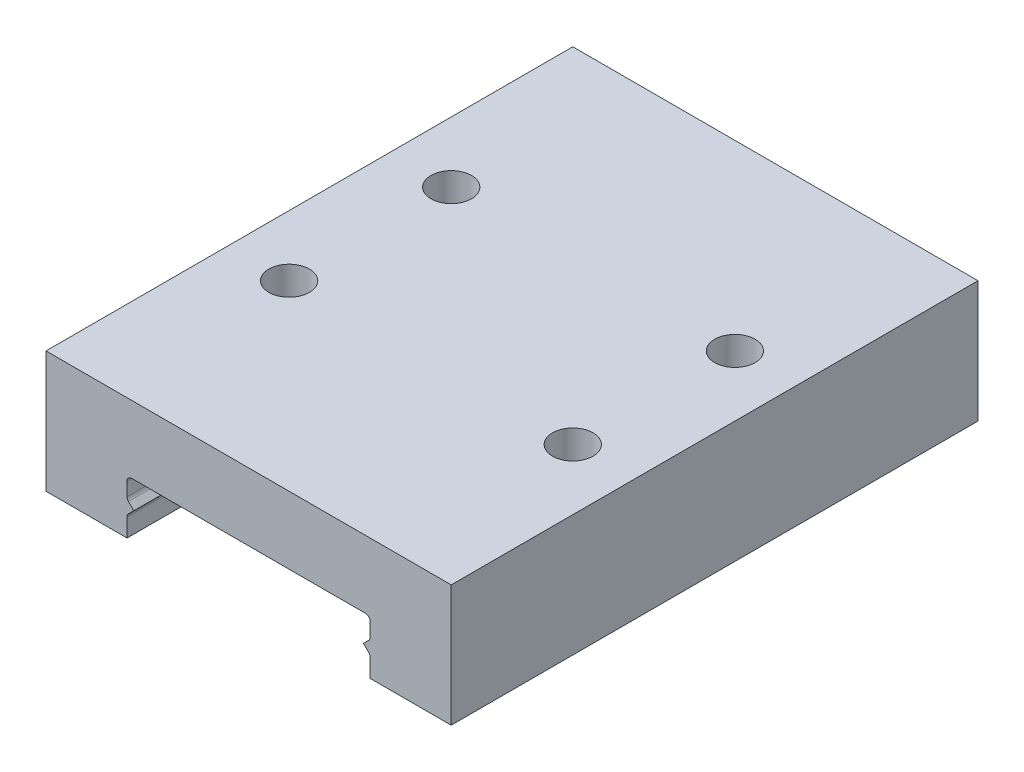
ISO-10303-21;
HEADER;
FILE_DESCRIPTION(('STEP AP214'),'2;1');
FILE_NAME('part.step','',(''),(''),'','','');
FILE_SCHEMA(('AUTOMOTIVE_DESIGN { 1 0 10303 214 1 1 1 1 }'));
ENDSEC;
DATA;
#1=APPLICATION_CONTEXT('core data for automotive mechanical design processes');
#2=APPLICATION_PROTOCOL_DEFINITION('international standard','automotive_design',2000,#1);
#3=PRODUCT_CONTEXT('',#1,'mechanical');
#4=PRODUCT('Part','Part','',(#3));
#5=PRODUCT_RELATED_PRODUCT_CATEGORY('part','',(#4));
#6=PRODUCT_DEFINITION_FORMATION('','',#4);
#7=PRODUCT_DEFINITION_CONTEXT('part definition',#1,'design');
#8=PRODUCT_DEFINITION('design','',#6,#7);
#9=PRODUCT_DEFINITION_SHAPE('','',#8);
#10=(LENGTH_UNIT() NAMED_UNIT(*) SI_UNIT(.MILLI.,.METRE.));
#11=(NAMED_UNIT(*) PLANE_ANGLE_UNIT() SI_UNIT($,.RADIAN.));
#12=(NAMED_UNIT(*) SI_UNIT($,.STERADIAN.) SOLID_ANGLE_UNIT());
#13=UNCERTAINTY_MEASURE_WITH_UNIT(LENGTH_MEASURE(1.E-05),#10,'distance_accuracy_value','');
#14=(GEOMETRIC_REPRESENTATION_CONTEXT(3) GLOBAL_UNCERTAINTY_ASSIGNED_CONTEXT((#13)) GLOBAL_UNIT_ASSIGNED_CONTEXT((#10,
#11,#12)) REPRESENTATION_CONTEXT('',''));
#15=CARTESIAN_POINT('',(0.,0.,0.));
#16=DIRECTION('',(0.,0.,1.));
#17=DIRECTION('',(1.,0.,0.));
#18=AXIS2_PLACEMENT_3D('',#15,#16,#17);
#19=CARTESIAN_POINT('',(-15.,3.,39.));
#20=DIRECTION('',(0.,1.,0.));
#21=DIRECTION('',(0.,0.,1.));
#22=AXIS2_PLACEMENT_3D('',#19,#20,#21);
#23=PLANE('',#22);
#24=DIRECTION('',(0.,0.,1.));
#25=VECTOR('',#24,1.);
#26=CARTESIAN_POINT('',(9.,3.,39.));
#27=LINE('',#26,#25);
#28=CARTESIAN_POINT('',(9.,3.,0.));
#29=VERTEX_POINT('',#28);
#30=CARTESIAN_POINT('',(9.,3.,39.));
#31=VERTEX_POINT('',#30);
#32=EDGE_CURVE('E257',#29,#31,#27,.T.);
#33=ORIENTED_EDGE('',*,*,#32,.F.);
#34=DIRECTION('',(1.,0.,0.));
#35=VECTOR('',#34,1.);
#36=CARTESIAN_POINT('',(-15.,3.,0.));
#37=LINE('',#36,#35);
#38=CARTESIAN_POINT('',(15.,3.,0.));
#39=VERTEX_POINT('',#38);
#40=EDGE_CURVE('E293',#29,#39,#37,.T.);
#41=ORIENTED_EDGE('',*,*,#40,.T.);
#42=DIRECTION('',(0.,0.,-1.));
#43=VECTOR('',#42,1.);
#44=CARTESIAN_POINT('',(15.,3.,39.));
#45=LINE('',#44,#43);
#46=CARTESIAN_POINT('',(15.,3.,39.));
#47=VERTEX_POINT('',#46);
#48=EDGE_CURVE('E318',#47,#39,#45,.T.);
#49=ORIENTED_EDGE('',*,*,#48,.F.);
#50=DIRECTION('',(1.,0.,0.));
#51=VECTOR('',#50,1.);
#52=CARTESIAN_POINT('',(-15.,3.,39.));
#53=LINE('',#52,#51);
#54=EDGE_CURVE('E304',#31,#47,#53,.T.);
#55=ORIENTED_EDGE('',*,*,#54,.F.);
#56=EDGE_LOOP('',(#33,#41,#49,#55));
#57=FACE_BOUND('',#56,.T.);
#58=ADVANCED_FACE('F30',(#57),#23,.F.);
#59=CARTESIAN_POINT('',(-15.,3.,39.));
#60=DIRECTION('',(0.,0.,1.));
#61=DIRECTION('',(1.,0.,0.));
#62=AXIS2_PLACEMENT_3D('',#59,#60,#61);
#63=PLANE('',#62);
#64=DIRECTION('',(-0.707106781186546,0.707106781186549,0.));
#65=VECTOR('',#64,1.);
#66=CARTESIAN_POINT('',(8.5,5.,39.));
#67=LINE('',#66,#65);
#68=CARTESIAN_POINT('',(8.89748737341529,4.60251262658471,39.));
#69=VERTEX_POINT('',#68);
#70=CARTESIAN_POINT('',(8.5,5.,39.));
#71=VERTEX_POINT('',#70);
#72=EDGE_CURVE('E249',#69,#71,#67,.T.);
#73=ORIENTED_EDGE('',*,*,#72,.F.);
#74=CARTESIAN_POINT('',(8.65,4.35502525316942,39.));
#75=DIRECTION('',(0.,0.,1.));
#76=DIRECTION('',(1.,0.,0.));
#77=AXIS2_PLACEMENT_3D('',#74,#75,#76);
#78=CIRCLE('',#77,0.35);
#79=CARTESIAN_POINT('',(9.,4.35502525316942,39.));
#80=VERTEX_POINT('',#79);
#81=EDGE_CURVE('E369',#69,#80,#78,.F.);
#82=ORIENTED_EDGE('',*,*,#81,.T.);
#83=DIRECTION('',(0.,1.,0.));
#84=VECTOR('',#83,1.);
#85=CARTESIAN_POINT('',(9.,0.830210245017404,39.));
#86=LINE('',#85,#84);
#87=EDGE_CURVE('E251',#31,#80,#86,.T.);
#88=ORIENTED_EDGE('',*,*,#87,.F.);
#89=ORIENTED_EDGE('',*,*,#54,.T.);
#90=DIRECTION('',(0.,1.,0.));
#91=VECTOR('',#90,1.);
#92=CARTESIAN_POINT('',(15.,12.,39.));
#93=LINE('',#92,#91);
#94=CARTESIAN_POINT('',(15.,12.,39.));
#95=VERTEX_POINT('',#94);
#96=EDGE_CURVE('E308',#47,#95,#93,.T.);
#97=ORIENTED_EDGE('',*,*,#96,.T.);
#98=DIRECTION('',(-1.,0.,0.));
#99=VECTOR('',#98,1.);
#100=CARTESIAN_POINT('',(-15.,12.,39.));
#101=LINE('',#100,#99);
#102=CARTESIAN_POINT('',(-15.,12.,39.));
#103=VERTEX_POINT('',#102);
#104=EDGE_CURVE('E310',#95,#103,#101,.T.);
#105=ORIENTED_EDGE('',*,*,#104,.T.);
#106=DIRECTION('',(0.,-1.,0.));
#107=VECTOR('',#106,1.);
#108=CARTESIAN_POINT('',(-15.,12.,39.));
#109=LINE('',#108,#107);
#110=CARTESIAN_POINT('',(-15.,3.,39.));
#111=VERTEX_POINT('',#110);
#112=EDGE_CURVE('E301',#103,#111,#109,.T.);
#113=ORIENTED_EDGE('',*,*,#112,.T.);
#114=CARTESIAN_POINT('',(-9.,3.,39.));
#115=VERTEX_POINT('',#114);
#116=EDGE_CURVE('E305',#111,#115,#53,.T.);
#117=ORIENTED_EDGE('',*,*,#116,.T.);
#118=DIRECTION('',(0.,1.,0.));
#119=VECTOR('',#118,1.);
#120=CARTESIAN_POINT('',(-9.,0.830210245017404,39.));
#121=LINE('',#120,#119);
#122=CARTESIAN_POINT('',(-9.,4.35502525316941,39.));
#123=VERTEX_POINT('',#122);
#124=EDGE_CURVE('E270',#115,#123,#121,.T.);
#125=ORIENTED_EDGE('',*,*,#124,.T.);
#126=CARTESIAN_POINT('',(-8.65,4.35502525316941,39.));
#127=DIRECTION('',(0.,0.,1.));
#128=DIRECTION('',(1.,0.,0.));
#129=AXIS2_PLACEMENT_3D('',#126,#127,#128);
#130=CIRCLE('',#129,0.35);
#131=CARTESIAN_POINT('',(-8.89748737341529,4.60251262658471,39.));
#132=VERTEX_POINT('',#131);
#133=EDGE_CURVE('E343',#123,#132,#130,.F.);
#134=ORIENTED_EDGE('',*,*,#133,.T.);
#135=DIRECTION('',(0.707106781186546,0.707106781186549,0.));
#136=VECTOR('',#135,1.);
#137=CARTESIAN_POINT('',(-8.5,5.,39.));
#138=LINE('',#137,#136);
#139=CARTESIAN_POINT('',(-8.5,5.,39.));
#140=VERTEX_POINT('',#139);
#141=EDGE_CURVE('E273',#132,#140,#138,.T.);
#142=ORIENTED_EDGE('',*,*,#141,.T.);
#143=DIRECTION('',(-0.707106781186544,0.707106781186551,0.));
#144=VECTOR('',#143,1.);
#145=CARTESIAN_POINT('',(-9.,5.5,39.));
#146=LINE('',#145,#144);
#147=CARTESIAN_POINT('',(-8.89748737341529,5.39748737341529,39.));
#148=VERTEX_POINT('',#147);
#149=EDGE_CURVE('E275',#140,#148,#146,.T.);
#150=ORIENTED_EDGE('',*,*,#149,.T.);
#151=CARTESIAN_POINT('',(-8.65,5.64497474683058,39.));
#152=DIRECTION('',(0.,0.,1.));
#153=DIRECTION('',(1.,0.,0.));
#154=AXIS2_PLACEMENT_3D('',#151,#152,#153);
#155=CIRCLE('',#154,0.35);
#156=CARTESIAN_POINT('',(-9.,5.64497474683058,39.));
#157=VERTEX_POINT('',#156);
#158=EDGE_CURVE('E351',#148,#157,#155,.F.);
#159=ORIENTED_EDGE('',*,*,#158,.T.);
#160=DIRECTION('',(0.,1.,0.));
#161=VECTOR('',#160,1.);
#162=CARTESIAN_POINT('',(-9.,7.,39.));
#163=LINE('',#162,#161);
#164=CARTESIAN_POINT('',(-9.,6.65,39.));
#165=VERTEX_POINT('',#164);
#166=EDGE_CURVE('E278',#157,#165,#163,.T.);
#167=ORIENTED_EDGE('',*,*,#166,.T.);
#168=CARTESIAN_POINT('',(-8.65,6.65,39.));
#169=DIRECTION('',(0.,0.,1.));
#170=DIRECTION('',(1.,0.,0.));
#171=AXIS2_PLACEMENT_3D('',#168,#169,#170);
#172=CIRCLE('',#171,0.35);
#173=CARTESIAN_POINT('',(-8.65,7.,39.));
#174=VERTEX_POINT('',#173);
#175=EDGE_CURVE('E347',#165,#174,#172,.F.);
#176=ORIENTED_EDGE('',*,*,#175,.T.);
#177=DIRECTION('',(1.,0.,0.));
#178=VECTOR('',#177,1.);
#179=CARTESIAN_POINT('',(0.,7.,39.));
#180=LINE('',#179,#178);
#181=CARTESIAN_POINT('',(8.65,7.,39.));
#182=VERTEX_POINT('',#181);
#183=EDGE_CURVE('E281',#174,#182,#180,.T.);
#184=ORIENTED_EDGE('',*,*,#183,.T.);
#185=CARTESIAN_POINT('',(8.65,6.65,39.));
#186=DIRECTION('',(0.,0.,1.));
#187=DIRECTION('',(1.,0.,0.));
#188=AXIS2_PLACEMENT_3D('',#185,#186,#187);
#189=CIRCLE('',#188,0.35);
#190=CARTESIAN_POINT('',(9.,6.65,39.));
#191=VERTEX_POINT('',#190);
#192=EDGE_CURVE('E373',#182,#191,#189,.F.);
#193=ORIENTED_EDGE('',*,*,#192,.T.);
#194=DIRECTION('',(0.,1.,0.));
#195=VECTOR('',#194,1.);
#196=CARTESIAN_POINT('',(9.,7.,39.));
#197=LINE('',#196,#195);
#198=CARTESIAN_POINT('',(9.,5.64497474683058,39.));
#199=VERTEX_POINT('',#198);
#200=EDGE_CURVE('E244',#199,#191,#197,.T.);
#201=ORIENTED_EDGE('',*,*,#200,.F.);
#202=CARTESIAN_POINT('',(8.65,5.64497474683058,39.));
#203=DIRECTION('',(0.,0.,1.));
#204=DIRECTION('',(1.,0.,0.));
#205=AXIS2_PLACEMENT_3D('',#202,#203,#204);
#206=CIRCLE('',#205,0.35);
#207=CARTESIAN_POINT('',(8.89748737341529,5.39748737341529,39.));
#208=VERTEX_POINT('',#207);
#209=EDGE_CURVE('E11',#199,#208,#206,.F.);
#210=ORIENTED_EDGE('',*,*,#209,.T.);
#211=DIRECTION('',(0.707106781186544,0.707106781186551,0.));
#212=VECTOR('',#211,1.);
#213=CARTESIAN_POINT('',(9.,5.5,39.));
#214=LINE('',#213,#212);
#215=EDGE_CURVE('E247',#71,#208,#214,.T.);
#216=ORIENTED_EDGE('',*,*,#215,.F.);
#217=EDGE_LOOP('',(#73,#82,#88,#89,#97,#105,#113,#117,#125,#134,#142,#150,#159,#167,#176,#184,
#193,#201,#210,#216));
#218=FACE_BOUND('',#217,.T.);
#219=ADVANCED_FACE('F386',(#218),#63,.T.);
#220=CARTESIAN_POINT('',(-15.,3.,0.));
#221=DIRECTION('',(0.,0.,1.));
#222=DIRECTION('',(1.,0.,0.));
#223=AXIS2_PLACEMENT_3D('',#220,#221,#222);
#224=PLANE('',#223);
#225=DIRECTION('',(0.,1.,0.));
#226=VECTOR('',#225,1.);
#227=CARTESIAN_POINT('',(9.,0.830210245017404,0.));
#228=LINE('',#227,#226);
#229=CARTESIAN_POINT('',(9.,4.35502525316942,0.));
#230=VERTEX_POINT('',#229);
#231=EDGE_CURVE('E241',#29,#230,#228,.T.);
#232=ORIENTED_EDGE('',*,*,#231,.T.);
#233=CARTESIAN_POINT('',(8.65,4.35502525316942,0.));
#234=DIRECTION('',(0.,0.,1.));
#235=DIRECTION('',(1.,0.,0.));
#236=AXIS2_PLACEMENT_3D('',#233,#234,#235);
#237=CIRCLE('',#236,0.35);
#238=CARTESIAN_POINT('',(8.89748737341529,4.60251262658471,0.));
#239=VERTEX_POINT('',#238);
#240=EDGE_CURVE('E367',#230,#239,#237,.T.);
#241=ORIENTED_EDGE('',*,*,#240,.T.);
#242=DIRECTION('',(-0.707106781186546,0.707106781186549,0.));
#243=VECTOR('',#242,1.);
#244=CARTESIAN_POINT('',(8.5,5.,0.));
#245=LINE('',#244,#243);
#246=CARTESIAN_POINT('',(8.5,5.,0.));
#247=VERTEX_POINT('',#246);
#248=EDGE_CURVE('E239',#239,#247,#245,.T.);
#249=ORIENTED_EDGE('',*,*,#248,.T.);
#250=DIRECTION('',(0.707106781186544,0.707106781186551,0.));
#251=VECTOR('',#250,1.);
#252=CARTESIAN_POINT('',(9.,5.5,0.));
#253=LINE('',#252,#251);
#254=CARTESIAN_POINT('',(8.89748737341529,5.39748737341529,0.));
#255=VERTEX_POINT('',#254);
#256=EDGE_CURVE('E236',#247,#255,#253,.T.);
#257=ORIENTED_EDGE('',*,*,#256,.T.);
#258=CARTESIAN_POINT('',(8.65,5.64497474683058,0.));
#259=DIRECTION('',(0.,0.,1.));
#260=DIRECTION('',(1.,0.,0.));
#261=AXIS2_PLACEMENT_3D('',#258,#259,#260);
#262=CIRCLE('',#261,0.35);
#263=CARTESIAN_POINT('',(9.,5.64497474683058,0.));
#264=VERTEX_POINT('',#263);
#265=EDGE_CURVE('E38',#255,#264,#262,.T.);
#266=ORIENTED_EDGE('',*,*,#265,.T.);
#267=DIRECTION('',(0.,1.,0.));
#268=VECTOR('',#267,1.);
#269=CARTESIAN_POINT('',(9.,7.,0.));
#270=LINE('',#269,#268);
#271=CARTESIAN_POINT('',(9.,6.65,0.));
#272=VERTEX_POINT('',#271);
#273=EDGE_CURVE('E233',#264,#272,#270,.T.);
#274=ORIENTED_EDGE('',*,*,#273,.T.);
#275=CARTESIAN_POINT('',(8.65,6.65,0.));
#276=DIRECTION('',(0.,0.,1.));
#277=DIRECTION('',(1.,0.,0.));
#278=AXIS2_PLACEMENT_3D('',#275,#276,#277);
#279=CIRCLE('',#278,0.35);
#280=CARTESIAN_POINT('',(8.65,7.,0.));
#281=VERTEX_POINT('',#280);
#282=EDGE_CURVE('E371',#272,#281,#279,.T.);
#283=ORIENTED_EDGE('',*,*,#282,.T.);
#284=DIRECTION('',(1.,0.,0.));
#285=VECTOR('',#284,1.);
#286=CARTESIAN_POINT('',(0.,7.,0.));
#287=LINE('',#286,#285);
#288=CARTESIAN_POINT('',(-8.65,7.,0.));
#289=VERTEX_POINT('',#288);
#290=EDGE_CURVE('E267',#289,#281,#287,.T.);
#291=ORIENTED_EDGE('',*,*,#290,.F.);
#292=CARTESIAN_POINT('',(-8.65,6.65,0.));
#293=DIRECTION('',(0.,0.,1.));
#294=DIRECTION('',(1.,0.,0.));
#295=AXIS2_PLACEMENT_3D('',#292,#293,#294);
#296=CIRCLE('',#295,0.35);
#297=CARTESIAN_POINT('',(-9.,6.65,0.));
#298=VERTEX_POINT('',#297);
#299=EDGE_CURVE('E345',#289,#298,#296,.T.);
#300=ORIENTED_EDGE('',*,*,#299,.T.);
#301=DIRECTION('',(0.,1.,0.));
#302=VECTOR('',#301,1.);
#303=CARTESIAN_POINT('',(-9.,7.,0.));
#304=LINE('',#303,#302);
#305=CARTESIAN_POINT('',(-9.,5.64497474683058,0.));
#306=VERTEX_POINT('',#305);
#307=EDGE_CURVE('E264',#306,#298,#304,.T.);
#308=ORIENTED_EDGE('',*,*,#307,.F.);
#309=CARTESIAN_POINT('',(-8.65,5.64497474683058,0.));
#310=DIRECTION('',(0.,0.,1.));
#311=DIRECTION('',(1.,0.,0.));
#312=AXIS2_PLACEMENT_3D('',#309,#310,#311);
#313=CIRCLE('',#312,0.35);
#314=CARTESIAN_POINT('',(-8.89748737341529,5.39748737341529,0.));
#315=VERTEX_POINT('',#314);
#316=EDGE_CURVE('E349',#306,#315,#313,.T.);
#317=ORIENTED_EDGE('',*,*,#316,.T.);
#318=DIRECTION('',(-0.707106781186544,0.707106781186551,0.));
#319=VECTOR('',#318,1.);
#320=CARTESIAN_POINT('',(-9.,5.5,0.));
#321=LINE('',#320,#319);
#322=CARTESIAN_POINT('',(-8.5,5.,0.));
#323=VERTEX_POINT('',#322);
#324=EDGE_CURVE('E261',#323,#315,#321,.T.);
#325=ORIENTED_EDGE('',*,*,#324,.F.);
#326=DIRECTION('',(0.707106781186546,0.707106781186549,0.));
#327=VECTOR('',#326,1.);
#328=CARTESIAN_POINT('',(-8.5,5.,0.));
#329=LINE('',#328,#327);
#330=CARTESIAN_POINT('',(-8.89748737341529,4.60251262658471,0.));
#331=VERTEX_POINT('',#330);
#332=EDGE_CURVE('E259',#331,#323,#329,.T.);
#333=ORIENTED_EDGE('',*,*,#332,.F.);
#334=CARTESIAN_POINT('',(-8.65,4.35502525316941,0.));
#335=DIRECTION('',(0.,0.,1.));
#336=DIRECTION('',(1.,0.,0.));
#337=AXIS2_PLACEMENT_3D('',#334,#335,#336);
#338=CIRCLE('',#337,0.35);
#339=CARTESIAN_POINT('',(-9.,4.35502525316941,0.));
#340=VERTEX_POINT('',#339);
#341=EDGE_CURVE('E341',#331,#340,#338,.T.);
#342=ORIENTED_EDGE('',*,*,#341,.T.);
#343=DIRECTION('',(0.,-1.,0.));
#344=VECTOR('',#343,1.);
#345=CARTESIAN_POINT('',(-9.,3.,0.));
#346=LINE('',#345,#344);
#347=CARTESIAN_POINT('',(-9.,3.,0.));
#348=VERTEX_POINT('',#347);
#349=EDGE_CURVE('E324',#340,#348,#346,.T.);
#350=ORIENTED_EDGE('',*,*,#349,.T.);
#351=CARTESIAN_POINT('',(-15.,3.,0.));
#352=VERTEX_POINT('',#351);
#353=EDGE_CURVE('E294',#352,#348,#37,.T.);
#354=ORIENTED_EDGE('',*,*,#353,.F.);
#355=DIRECTION('',(0.,-1.,0.));
#356=VECTOR('',#355,1.);
#357=CARTESIAN_POINT('',(-15.,12.,0.));
#358=LINE('',#357,#356);
#359=CARTESIAN_POINT('',(-15.,12.,0.));
#360=VERTEX_POINT('',#359);
#361=EDGE_CURVE('E290',#360,#352,#358,.T.);
#362=ORIENTED_EDGE('',*,*,#361,.F.);
#363=DIRECTION('',(-1.,0.,0.));
#364=VECTOR('',#363,1.);
#365=CARTESIAN_POINT('',(-15.,12.,0.));
#366=LINE('',#365,#364);
#367=CARTESIAN_POINT('',(15.,12.,0.));
#368=VERTEX_POINT('',#367);
#369=EDGE_CURVE('E299',#368,#360,#366,.T.);
#370=ORIENTED_EDGE('',*,*,#369,.F.);
#371=DIRECTION('',(0.,1.,0.));
#372=VECTOR('',#371,1.);
#373=CARTESIAN_POINT('',(15.,12.,0.));
#374=LINE('',#373,#372);
#375=EDGE_CURVE('E297',#39,#368,#374,.T.);
#376=ORIENTED_EDGE('',*,*,#375,.F.);
#377=ORIENTED_EDGE('',*,*,#40,.F.);
#378=EDGE_LOOP('',(#232,#241,#249,#257,#266,#274,#283,#291,#300,#308,#317,#325,#333,#342,#350,
#354,#362,#370,#376,#377));
#379=FACE_BOUND('',#378,.T.);
#380=ADVANCED_FACE('F376',(#379),#224,.F.);
#381=CARTESIAN_POINT('',(-15.,12.,39.));
#382=DIRECTION('',(1.,0.,0.));
#383=DIRECTION('',(0.,1.,0.));
#384=AXIS2_PLACEMENT_3D('',#381,#382,#383);
#385=PLANE('',#384);
#386=ORIENTED_EDGE('',*,*,#361,.T.);
#387=DIRECTION('',(0.,0.,-1.));
#388=VECTOR('',#387,1.);
#389=CARTESIAN_POINT('',(-15.,3.,39.));
#390=LINE('',#389,#388);
#391=EDGE_CURVE('E321',#111,#352,#390,.T.);
#392=ORIENTED_EDGE('',*,*,#391,.F.);
#393=ORIENTED_EDGE('',*,*,#112,.F.);
#394=DIRECTION('',(0.,0.,-1.));
#395=VECTOR('',#394,1.);
#396=CARTESIAN_POINT('',(-15.,12.,39.));
#397=LINE('',#396,#395);
#398=EDGE_CURVE('E312',#103,#360,#397,.T.);
#399=ORIENTED_EDGE('',*,*,#398,.T.);
#400=EDGE_LOOP('',(#386,#392,#393,#399));
#401=FACE_BOUND('',#400,.T.);
#402=ADVANCED_FACE('F32',(#401),#385,.F.);
#403=ORIENTED_EDGE('',*,*,#353,.T.);
#404=DIRECTION('',(0.,0.,1.));
#405=VECTOR('',#404,1.);
#406=CARTESIAN_POINT('',(-9.,3.,39.));
#407=LINE('',#406,#405);
#408=EDGE_CURVE('E287',#348,#115,#407,.T.);
#409=ORIENTED_EDGE('',*,*,#408,.T.);
#410=ORIENTED_EDGE('',*,*,#116,.F.);
#411=ORIENTED_EDGE('',*,*,#391,.T.);
#412=EDGE_LOOP('',(#403,#409,#410,#411));
#413=FACE_BOUND('',#412,.T.);
#414=ADVANCED_FACE('F417',(#413),#23,.F.);
#415=CARTESIAN_POINT('',(15.,12.,39.));
#416=DIRECTION('',(-1.,0.,0.));
#417=DIRECTION('',(0.,-1.,0.));
#418=AXIS2_PLACEMENT_3D('',#415,#416,#417);
#419=PLANE('',#418);
#420=ORIENTED_EDGE('',*,*,#375,.T.);
#421=DIRECTION('',(0.,0.,-1.));
#422=VECTOR('',#421,1.);
#423=CARTESIAN_POINT('',(15.,12.,39.));
#424=LINE('',#423,#422);
#425=EDGE_CURVE('E315',#95,#368,#424,.T.);
#426=ORIENTED_EDGE('',*,*,#425,.F.);
#427=ORIENTED_EDGE('',*,*,#96,.F.);
#428=ORIENTED_EDGE('',*,*,#48,.T.);
#429=EDGE_LOOP('',(#420,#426,#427,#428));
#430=FACE_BOUND('',#429,.T.);
#431=ADVANCED_FACE('F406',(#430),#419,.F.);
#432=CARTESIAN_POINT('',(-15.,12.,39.));
#433=DIRECTION('',(0.,-1.,0.));
#434=DIRECTION('',(0.,0.,-1.));
#435=AXIS2_PLACEMENT_3D('',#432,#433,#434);
#436=PLANE('',#435);
#437=CARTESIAN_POINT('',(10.5,12.,25.5));
#438=DIRECTION('',(0.,1.,0.));
#439=DIRECTION('',(0.,0.,1.));
#440=AXIS2_PLACEMENT_3D('',#437,#438,#439);
#441=CIRCLE('',#440,1.5);
#442=CARTESIAN_POINT('',(10.5,12.,27.));
#443=VERTEX_POINT('',#442);
#444=EDGE_CURVE('E194',#443,#443,#441,.T.);
#445=ORIENTED_EDGE('',*,*,#444,.F.);
#446=EDGE_LOOP('',(#445));
#447=FACE_BOUND('',#446,.T.);
#448=CARTESIAN_POINT('',(-10.5,12.,25.5));
#449=DIRECTION('',(0.,1.,0.));
#450=DIRECTION('',(0.,0.,1.));
#451=AXIS2_PLACEMENT_3D('',#448,#449,#450);
#452=CIRCLE('',#451,1.5);
#453=CARTESIAN_POINT('',(-10.5,12.,27.));
#454=VERTEX_POINT('',#453);
#455=EDGE_CURVE('E206',#454,#454,#452,.T.);
#456=ORIENTED_EDGE('',*,*,#455,.F.);
#457=EDGE_LOOP('',(#456));
#458=FACE_BOUND('',#457,.T.);
#459=CARTESIAN_POINT('',(10.5,12.,13.5));
#460=DIRECTION('',(0.,1.,0.));
#461=DIRECTION('',(0.,0.,1.));
#462=AXIS2_PLACEMENT_3D('',#459,#460,#461);
#463=CIRCLE('',#462,1.5);
#464=CARTESIAN_POINT('',(10.5,12.,15.));
#465=VERTEX_POINT('',#464);
#466=EDGE_CURVE('E218',#465,#465,#463,.T.);
#467=ORIENTED_EDGE('',*,*,#466,.F.);
#468=EDGE_LOOP('',(#467));
#469=FACE_BOUND('',#468,.T.);
#470=CARTESIAN_POINT('',(-10.5,12.,13.5));
#471=DIRECTION('',(0.,1.,0.));
#472=DIRECTION('',(0.,0.,1.));
#473=AXIS2_PLACEMENT_3D('',#470,#471,#472);
#474=CIRCLE('',#473,1.5);
#475=CARTESIAN_POINT('',(-10.5,12.,15.));
#476=VERTEX_POINT('',#475);
#477=EDGE_CURVE('E230',#476,#476,#474,.T.);
#478=ORIENTED_EDGE('',*,*,#477,.F.);
#479=EDGE_LOOP('',(#478));
#480=FACE_BOUND('',#479,.T.);
#481=ORIENTED_EDGE('',*,*,#369,.T.);
#482=ORIENTED_EDGE('',*,*,#398,.F.);
#483=ORIENTED_EDGE('',*,*,#104,.F.);
#484=ORIENTED_EDGE('',*,*,#425,.T.);
#485=EDGE_LOOP('',(#481,#482,#483,#484));
#486=FACE_BOUND('',#485,.T.);
#487=ADVANCED_FACE('F413',(#447,#458,#469,#480,#486),#436,.F.);
#488=CARTESIAN_POINT('',(-9.,0.830210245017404,39.));
#489=DIRECTION('',(-1.,0.,0.));
#490=DIRECTION('',(0.,0.,1.));
#491=AXIS2_PLACEMENT_3D('',#488,#489,#490);
#492=PLANE('',#491);
#493=ORIENTED_EDGE('',*,*,#349,.F.);
#494=DIRECTION('',(0.,0.,-1.));
#495=VECTOR('',#494,1.);
#496=CARTESIAN_POINT('',(-9.,4.35502525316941,39.));
#497=LINE('',#496,#495);
#498=EDGE_CURVE('E329',#340,#123,#497,.F.);
#499=ORIENTED_EDGE('',*,*,#498,.T.);
#500=ORIENTED_EDGE('',*,*,#124,.F.);
#501=ORIENTED_EDGE('',*,*,#408,.F.);
#502=EDGE_LOOP('',(#493,#499,#500,#501));
#503=FACE_BOUND('',#502,.T.);
#504=ADVANCED_FACE('F484',(#503),#492,.F.);
#505=CARTESIAN_POINT('',(0.,7.,39.));
#506=DIRECTION('',(0.,1.,0.));
#507=DIRECTION('',(0.,0.,1.));
#508=AXIS2_PLACEMENT_3D('',#505,#506,#507);
#509=PLANE('',#508);
#510=ORIENTED_EDGE('',*,*,#290,.T.);
#511=DIRECTION('',(0.,0.,-1.));
#512=VECTOR('',#511,1.);
#513=CARTESIAN_POINT('',(8.65,7.,39.));
#514=LINE('',#513,#512);
#515=EDGE_CURVE('E363',#281,#182,#514,.F.);
#516=ORIENTED_EDGE('',*,*,#515,.T.);
#517=ORIENTED_EDGE('',*,*,#183,.F.);
#518=DIRECTION('',(0.,0.,-1.));
#519=VECTOR('',#518,1.);
#520=CARTESIAN_POINT('',(-8.65,7.,0.));
#521=LINE('',#520,#519);
#522=EDGE_CURVE('E331',#174,#289,#521,.T.);
#523=ORIENTED_EDGE('',*,*,#522,.T.);
#524=EDGE_LOOP('',(#510,#516,#517,#523));
#525=FACE_BOUND('',#524,.T.);
#526=ADVANCED_FACE('F452',(#525),#509,.F.);
#527=CARTESIAN_POINT('',(-9.,7.,39.));
#528=DIRECTION('',(-1.,0.,0.));
#529=DIRECTION('',(0.,-1.,0.));
#530=AXIS2_PLACEMENT_3D('',#527,#528,#529);
#531=PLANE('',#530);
#532=ORIENTED_EDGE('',*,*,#307,.T.);
#533=DIRECTION('',(0.,0.,-1.));
#534=VECTOR('',#533,1.);
#535=CARTESIAN_POINT('',(-9.,6.65,39.));
#536=LINE('',#535,#534);
#537=EDGE_CURVE('E337',#298,#165,#536,.F.);
#538=ORIENTED_EDGE('',*,*,#537,.T.);
#539=ORIENTED_EDGE('',*,*,#166,.F.);
#540=DIRECTION('',(0.,0.,-1.));
#541=VECTOR('',#540,1.);
#542=CARTESIAN_POINT('',(-9.,5.64497474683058,0.));
#543=LINE('',#542,#541);
#544=EDGE_CURVE('E334',#157,#306,#543,.T.);
#545=ORIENTED_EDGE('',*,*,#544,.T.);
#546=EDGE_LOOP('',(#532,#538,#539,#545));
#547=FACE_BOUND('',#546,.T.);
#548=ADVANCED_FACE('F444',(#547),#531,.F.);
#549=CARTESIAN_POINT('',(-9.,5.5,39.));
#550=DIRECTION('',(-0.707106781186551,-0.707106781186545,0.));
#551=DIRECTION('',(0.707106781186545,-0.707106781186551,0.));
#552=AXIS2_PLACEMENT_3D('',#549,#550,#551);
#553=PLANE('',#552);
#554=ORIENTED_EDGE('',*,*,#324,.T.);
#555=DIRECTION('',(0.,0.,-1.));
#556=VECTOR('',#555,1.);
#557=CARTESIAN_POINT('',(-8.89748737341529,5.39748737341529,39.));
#558=LINE('',#557,#556);
#559=EDGE_CURVE('E339',#315,#148,#558,.F.);
#560=ORIENTED_EDGE('',*,*,#559,.T.);
#561=ORIENTED_EDGE('',*,*,#149,.F.);
#562=DIRECTION('',(0.,0.,-1.));
#563=VECTOR('',#562,1.);
#564=CARTESIAN_POINT('',(-8.5,5.,39.));
#565=LINE('',#564,#563);
#566=EDGE_CURVE('E284',#140,#323,#565,.T.);
#567=ORIENTED_EDGE('',*,*,#566,.T.);
#568=EDGE_LOOP('',(#554,#560,#561,#567));
#569=FACE_BOUND('',#568,.T.);
#570=ADVANCED_FACE('F435',(#569),#553,.F.);
#571=CARTESIAN_POINT('',(-8.5,5.,39.));
#572=DIRECTION('',(-0.707106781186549,0.707106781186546,0.));
#573=DIRECTION('',(-0.707106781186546,-0.707106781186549,0.));
#574=AXIS2_PLACEMENT_3D('',#571,#572,#573);
#575=PLANE('',#574);
#576=ORIENTED_EDGE('',*,*,#141,.F.);
#577=DIRECTION('',(0.,0.,-1.));
#578=VECTOR('',#577,1.);
#579=CARTESIAN_POINT('',(-8.89748737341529,4.60251262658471,0.));
#580=LINE('',#579,#578);
#581=EDGE_CURVE('E326',#132,#331,#580,.T.);
#582=ORIENTED_EDGE('',*,*,#581,.T.);
#583=ORIENTED_EDGE('',*,*,#332,.T.);
#584=ORIENTED_EDGE('',*,*,#566,.F.);
#585=EDGE_LOOP('',(#576,#582,#583,#584));
#586=FACE_BOUND('',#585,.T.);
#587=ADVANCED_FACE('F428',(#586),#575,.F.);
#588=CARTESIAN_POINT('',(-8.65,4.35502525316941,39.));
#589=DIRECTION('',(0.,0.,1.));
#590=DIRECTION('',(1.,0.,0.));
#591=AXIS2_PLACEMENT_3D('',#588,#589,#590);
#592=CYLINDRICAL_SURFACE('',#591,0.35);
#593=ORIENTED_EDGE('',*,*,#133,.F.);
#594=ORIENTED_EDGE('',*,*,#498,.F.);
#595=ORIENTED_EDGE('',*,*,#341,.F.);
#596=ORIENTED_EDGE('',*,*,#581,.F.);
#597=EDGE_LOOP('',(#593,#594,#595,#596));
#598=FACE_BOUND('',#597,.T.);
#599=ADVANCED_FACE('F425',(#598),#592,.F.);
#600=CARTESIAN_POINT('',(-8.65,6.65,39.));
#601=DIRECTION('',(0.,0.,1.));
#602=DIRECTION('',(1.,0.,0.));
#603=AXIS2_PLACEMENT_3D('',#600,#601,#602);
#604=CYLINDRICAL_SURFACE('',#603,0.35);
#605=ORIENTED_EDGE('',*,*,#175,.F.);
#606=ORIENTED_EDGE('',*,*,#537,.F.);
#607=ORIENTED_EDGE('',*,*,#299,.F.);
#608=ORIENTED_EDGE('',*,*,#522,.F.);
#609=EDGE_LOOP('',(#605,#606,#607,#608));
#610=FACE_BOUND('',#609,.T.);
#611=ADVANCED_FACE('F447',(#610),#604,.F.);
#612=CARTESIAN_POINT('',(-8.65,5.64497474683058,39.));
#613=DIRECTION('',(0.,0.,1.));
#614=DIRECTION('',(1.,0.,0.));
#615=AXIS2_PLACEMENT_3D('',#612,#613,#614);
#616=CYLINDRICAL_SURFACE('',#615,0.35);
#617=ORIENTED_EDGE('',*,*,#158,.F.);
#618=ORIENTED_EDGE('',*,*,#559,.F.);
#619=ORIENTED_EDGE('',*,*,#316,.F.);
#620=ORIENTED_EDGE('',*,*,#544,.F.);
#621=EDGE_LOOP('',(#617,#618,#619,#620));
#622=FACE_BOUND('',#621,.T.);
#623=ADVANCED_FACE('F439',(#622),#616,.F.);
#624=CARTESIAN_POINT('',(9.,0.830210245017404,39.));
#625=DIRECTION('',(-1.,0.,0.));
#626=DIRECTION('',(0.,0.,1.));
#627=AXIS2_PLACEMENT_3D('',#624,#625,#626);
#628=PLANE('',#627);
#629=ORIENTED_EDGE('',*,*,#87,.T.);
#630=DIRECTION('',(0.,0.,-1.));
#631=VECTOR('',#630,1.);
#632=CARTESIAN_POINT('',(9.,4.35502525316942,0.));
#633=LINE('',#632,#631);
#634=EDGE_CURVE('E353',#80,#230,#633,.T.);
#635=ORIENTED_EDGE('',*,*,#634,.T.);
#636=ORIENTED_EDGE('',*,*,#231,.F.);
#637=ORIENTED_EDGE('',*,*,#32,.T.);
#638=EDGE_LOOP('',(#629,#635,#636,#637));
#639=FACE_BOUND('',#638,.T.);
#640=ADVANCED_FACE('F395',(#639),#628,.T.);
#641=CARTESIAN_POINT('',(8.5,5.,39.));
#642=DIRECTION('',(-0.707106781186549,-0.707106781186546,0.));
#643=DIRECTION('',(0.707106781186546,-0.707106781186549,0.));
#644=AXIS2_PLACEMENT_3D('',#641,#642,#643);
#645=PLANE('',#644);
#646=ORIENTED_EDGE('',*,*,#248,.F.);
#647=DIRECTION('',(0.,0.,-1.));
#648=VECTOR('',#647,1.);
#649=CARTESIAN_POINT('',(8.89748737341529,4.60251262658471,39.));
#650=LINE('',#649,#648);
#651=EDGE_CURVE('E356',#239,#69,#650,.F.);
#652=ORIENTED_EDGE('',*,*,#651,.T.);
#653=ORIENTED_EDGE('',*,*,#72,.T.);
#654=DIRECTION('',(0.,0.,-1.));
#655=VECTOR('',#654,1.);
#656=CARTESIAN_POINT('',(8.5,5.,39.));
#657=LINE('',#656,#655);
#658=EDGE_CURVE('E254',#71,#247,#657,.T.);
#659=ORIENTED_EDGE('',*,*,#658,.T.);
#660=EDGE_LOOP('',(#646,#652,#653,#659));
#661=FACE_BOUND('',#660,.T.);
#662=ADVANCED_FACE('F648',(#661),#645,.T.);
#663=CARTESIAN_POINT('',(9.,5.5,39.));
#664=DIRECTION('',(-0.707106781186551,0.707106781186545,0.));
#665=DIRECTION('',(-0.707106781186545,-0.707106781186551,0.));
#666=AXIS2_PLACEMENT_3D('',#663,#664,#665);
#667=PLANE('',#666);
#668=ORIENTED_EDGE('',*,*,#215,.T.);
#669=DIRECTION('',(0.,0.,-1.));
#670=VECTOR('',#669,1.);
#671=CARTESIAN_POINT('',(8.89748737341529,5.39748737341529,0.));
#672=LINE('',#671,#670);
#673=EDGE_CURVE('E365',#208,#255,#672,.T.);
#674=ORIENTED_EDGE('',*,*,#673,.T.);
#675=ORIENTED_EDGE('',*,*,#256,.F.);
#676=ORIENTED_EDGE('',*,*,#658,.F.);
#677=EDGE_LOOP('',(#668,#674,#675,#676));
#678=FACE_BOUND('',#677,.T.);
#679=ADVANCED_FACE('F383',(#678),#667,.T.);
#680=CARTESIAN_POINT('',(9.,7.,39.));
#681=DIRECTION('',(-1.,0.,0.));
#682=DIRECTION('',(0.,-1.,0.));
#683=AXIS2_PLACEMENT_3D('',#680,#681,#682);
#684=PLANE('',#683);
#685=ORIENTED_EDGE('',*,*,#200,.T.);
#686=DIRECTION('',(0.,0.,-1.));
#687=VECTOR('',#686,1.);
#688=CARTESIAN_POINT('',(9.,6.65,39.));
#689=LINE('',#688,#687);
#690=EDGE_CURVE('E360',#191,#272,#689,.T.);
#691=ORIENTED_EDGE('',*,*,#690,.T.);
#692=ORIENTED_EDGE('',*,*,#273,.F.);
#693=DIRECTION('',(0.,0.,-1.));
#694=VECTOR('',#693,1.);
#695=CARTESIAN_POINT('',(9.,5.64497474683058,39.));
#696=LINE('',#695,#694);
#697=EDGE_CURVE('E358',#264,#199,#696,.F.);
#698=ORIENTED_EDGE('',*,*,#697,.T.);
#699=EDGE_LOOP('',(#685,#691,#692,#698));
#700=FACE_BOUND('',#699,.T.);
#701=ADVANCED_FACE('F379',(#700),#684,.T.);
#702=CARTESIAN_POINT('',(8.65,4.35502525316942,39.));
#703=DIRECTION('',(0.,0.,1.));
#704=DIRECTION('',(1.,0.,0.));
#705=AXIS2_PLACEMENT_3D('',#702,#703,#704);
#706=CYLINDRICAL_SURFACE('',#705,0.35);
#707=ORIENTED_EDGE('',*,*,#81,.F.);
#708=ORIENTED_EDGE('',*,*,#651,.F.);
#709=ORIENTED_EDGE('',*,*,#240,.F.);
#710=ORIENTED_EDGE('',*,*,#634,.F.);
#711=EDGE_LOOP('',(#707,#708,#709,#710));
#712=FACE_BOUND('',#711,.T.);
#713=ADVANCED_FACE('F393',(#712),#706,.F.);
#714=CARTESIAN_POINT('',(8.65,6.65,39.));
#715=DIRECTION('',(0.,0.,-1.));
#716=DIRECTION('',(-1.,0.,0.));
#717=AXIS2_PLACEMENT_3D('',#714,#715,#716);
#718=CYLINDRICAL_SURFACE('',#717,0.35);
#719=ORIENTED_EDGE('',*,*,#192,.F.);
#720=ORIENTED_EDGE('',*,*,#515,.F.);
#721=ORIENTED_EDGE('',*,*,#282,.F.);
#722=ORIENTED_EDGE('',*,*,#690,.F.);
#723=EDGE_LOOP('',(#719,#720,#721,#722));
#724=FACE_BOUND('',#723,.T.);
#725=ADVANCED_FACE('F456',(#724),#718,.F.);
#726=CARTESIAN_POINT('',(8.65,5.64497474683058,39.));
#727=DIRECTION('',(0.,0.,1.));
#728=DIRECTION('',(1.,0.,0.));
#729=AXIS2_PLACEMENT_3D('',#726,#727,#728);
#730=CYLINDRICAL_SURFACE('',#729,0.35);
#731=ORIENTED_EDGE('',*,*,#209,.F.);
#732=ORIENTED_EDGE('',*,*,#697,.F.);
#733=ORIENTED_EDGE('',*,*,#265,.F.);
#734=ORIENTED_EDGE('',*,*,#673,.F.);
#735=EDGE_LOOP('',(#731,#732,#733,#734));
#736=FACE_BOUND('',#735,.T.);
#737=ADVANCED_FACE('F381',(#736),#730,.F.);
#738=CARTESIAN_POINT('',(-10.5,12.,13.5));
#739=DIRECTION('',(0.,1.,0.));
#740=DIRECTION('',(0.,0.,1.));
#741=AXIS2_PLACEMENT_3D('',#738,#739,#740);
#742=CYLINDRICAL_SURFACE('',#741,1.5);
#743=CARTESIAN_POINT('',(-10.5,9.,13.5));
#744=DIRECTION('',(0.,1.,0.));
#745=DIRECTION('',(0.,0.,1.));
#746=AXIS2_PLACEMENT_3D('',#743,#744,#745);
#747=CIRCLE('',#746,1.5);
#748=CARTESIAN_POINT('',(-10.5,9.,15.));
#749=VERTEX_POINT('',#748);
#750=EDGE_CURVE('E227',#749,#749,#747,.T.);
#751=ORIENTED_EDGE('',*,*,#750,.F.);
#752=EDGE_LOOP('',(#751));
#753=FACE_BOUND('',#752,.T.);
#754=ORIENTED_EDGE('',*,*,#477,.T.);
#755=EDGE_LOOP('',(#754));
#756=FACE_BOUND('',#755,.T.);
#757=ADVANCED_FACE('F463',(#753,#756),#742,.F.);
#758=CARTESIAN_POINT('',(-9.25,9.,13.5));
#759=DIRECTION('',(0.,-1.,0.));
#760=DIRECTION('',(0.,0.,-1.));
#761=AXIS2_PLACEMENT_3D('',#758,#759,#760);
#762=PLANE('',#761);
#763=CARTESIAN_POINT('',(-10.5,9.,13.5));
#764=DIRECTION('',(0.,1.,0.));
#765=DIRECTION('',(0.,0.,1.));
#766=AXIS2_PLACEMENT_3D('',#763,#764,#765);
#767=CIRCLE('',#766,1.25);
#768=CARTESIAN_POINT('',(-10.5,9.,14.75));
#769=VERTEX_POINT('',#768);
#770=EDGE_CURVE('E224',#769,#769,#767,.T.);
#771=ORIENTED_EDGE('',*,*,#770,.F.);
#772=EDGE_LOOP('',(#771));
#773=FACE_BOUND('',#772,.T.);
#774=ORIENTED_EDGE('',*,*,#750,.T.);
#775=EDGE_LOOP('',(#774));
#776=FACE_BOUND('',#775,.T.);
#777=ADVANCED_FACE('F501',(#773,#776),#762,.F.);
#778=CARTESIAN_POINT('',(-10.5,12.,13.5));
#779=DIRECTION('',(0.,1.,0.));
#780=DIRECTION('',(0.,0.,1.));
#781=AXIS2_PLACEMENT_3D('',#778,#779,#780);
#782=CYLINDRICAL_SURFACE('',#781,1.25);
#783=CARTESIAN_POINT('',(-10.5,7.5,13.5));
#784=DIRECTION('',(0.,1.,0.));
#785=DIRECTION('',(0.,0.,1.));
#786=AXIS2_PLACEMENT_3D('',#783,#784,#785);
#787=CIRCLE('',#786,1.25);
#788=CARTESIAN_POINT('',(-10.5,7.5,14.75));
#789=VERTEX_POINT('',#788);
#790=EDGE_CURVE('E221',#789,#789,#787,.T.);
#791=ORIENTED_EDGE('',*,*,#790,.F.);
#792=EDGE_LOOP('',(#791));
#793=FACE_BOUND('',#792,.T.);
#794=ORIENTED_EDGE('',*,*,#770,.T.);
#795=EDGE_LOOP('',(#794));
#796=FACE_BOUND('',#795,.T.);
#797=ADVANCED_FACE('F507',(#793,#796),#782,.F.);
#798=CARTESIAN_POINT('',(-10.5,7.5,13.5));
#799=DIRECTION('',(0.,1.,0.));
#800=DIRECTION('',(0.,0.,1.));
#801=AXIS2_PLACEMENT_3D('',#798,#799,#800);
#802=CONICAL_SURFACE('',#801,1.25,1.02974425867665);
#803=CARTESIAN_POINT('',(-10.5,6.74892422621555,13.5));
#804=VERTEX_POINT('',#803);
#805=VERTEX_LOOP('',#804);
#806=FACE_BOUND('',#805,.T.);
#807=ORIENTED_EDGE('',*,*,#790,.T.);
#808=EDGE_LOOP('',(#807));
#809=FACE_BOUND('',#808,.T.);
#810=ADVANCED_FACE('F514',(#806,#809),#802,.F.);
#811=CARTESIAN_POINT('',(10.5,12.,13.5));
#812=DIRECTION('',(0.,1.,0.));
#813=DIRECTION('',(0.,0.,1.));
#814=AXIS2_PLACEMENT_3D('',#811,#812,#813);
#815=CYLINDRICAL_SURFACE('',#814,1.5);
#816=CARTESIAN_POINT('',(10.5,9.,13.5));
#817=DIRECTION('',(0.,1.,0.));
#818=DIRECTION('',(0.,0.,1.));
#819=AXIS2_PLACEMENT_3D('',#816,#817,#818);
#820=CIRCLE('',#819,1.5);
#821=CARTESIAN_POINT('',(10.5,9.,15.));
#822=VERTEX_POINT('',#821);
#823=EDGE_CURVE('E215',#822,#822,#820,.T.);
#824=ORIENTED_EDGE('',*,*,#823,.F.);
#825=EDGE_LOOP('',(#824));
#826=FACE_BOUND('',#825,.T.);
#827=ORIENTED_EDGE('',*,*,#466,.T.);
#828=EDGE_LOOP('',(#827));
#829=FACE_BOUND('',#828,.T.);
#830=ADVANCED_FACE('F518',(#826,#829),#815,.F.);
#831=CARTESIAN_POINT('',(11.75,9.,13.5));
#832=DIRECTION('',(0.,-1.,0.));
#833=DIRECTION('',(0.,0.,-1.));
#834=AXIS2_PLACEMENT_3D('',#831,#832,#833);
#835=PLANE('',#834);
#836=CARTESIAN_POINT('',(10.5,9.,13.5));
#837=DIRECTION('',(0.,1.,0.));
#838=DIRECTION('',(0.,0.,1.));
#839=AXIS2_PLACEMENT_3D('',#836,#837,#838);
#840=CIRCLE('',#839,1.25);
#841=CARTESIAN_POINT('',(10.5,9.,14.75));
#842=VERTEX_POINT('',#841);
#843=EDGE_CURVE('E212',#842,#842,#840,.T.);
#844=ORIENTED_EDGE('',*,*,#843,.F.);
#845=EDGE_LOOP('',(#844));
#846=FACE_BOUND('',#845,.T.);
#847=ORIENTED_EDGE('',*,*,#823,.T.);
#848=EDGE_LOOP('',(#847));
#849=FACE_BOUND('',#848,.T.);
#850=ADVANCED_FACE('F522',(#846,#849),#835,.F.);
#851=CARTESIAN_POINT('',(10.5,12.,13.5));
#852=DIRECTION('',(0.,1.,0.));
#853=DIRECTION('',(0.,0.,1.));
#854=AXIS2_PLACEMENT_3D('',#851,#852,#853);
#855=CYLINDRICAL_SURFACE('',#854,1.25);
#856=CARTESIAN_POINT('',(10.5,7.5,13.5));
#857=DIRECTION('',(0.,1.,0.));
#858=DIRECTION('',(0.,0.,1.));
#859=AXIS2_PLACEMENT_3D('',#856,#857,#858);
#860=CIRCLE('',#859,1.25);
#861=CARTESIAN_POINT('',(10.5,7.5,14.75));
#862=VERTEX_POINT('',#861);
#863=EDGE_CURVE('E209',#862,#862,#860,.T.);
#864=ORIENTED_EDGE('',*,*,#863,.F.);
#865=EDGE_LOOP('',(#864));
#866=FACE_BOUND('',#865,.T.);
#867=ORIENTED_EDGE('',*,*,#843,.T.);
#868=EDGE_LOOP('',(#867));
#869=FACE_BOUND('',#868,.T.);
#870=ADVANCED_FACE('F526',(#866,#869),#855,.F.);
#871=CARTESIAN_POINT('',(10.5,7.5,13.5));
#872=DIRECTION('',(0.,1.,0.));
#873=DIRECTION('',(0.,0.,1.));
#874=AXIS2_PLACEMENT_3D('',#871,#872,#873);
#875=CONICAL_SURFACE('',#874,1.25,1.02974425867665);
#876=CARTESIAN_POINT('',(10.5,6.74892422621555,13.5));
#877=VERTEX_POINT('',#876);
#878=VERTEX_LOOP('',#877);
#879=FACE_BOUND('',#878,.T.);
#880=ORIENTED_EDGE('',*,*,#863,.T.);
#881=EDGE_LOOP('',(#880));
#882=FACE_BOUND('',#881,.T.);
#883=ADVANCED_FACE('F530',(#879,#882),#875,.F.);
#884=CARTESIAN_POINT('',(-10.5,12.,25.5));
#885=DIRECTION('',(0.,1.,0.));
#886=DIRECTION('',(0.,0.,1.));
#887=AXIS2_PLACEMENT_3D('',#884,#885,#886);
#888=CYLINDRICAL_SURFACE('',#887,1.5);
#889=CARTESIAN_POINT('',(-10.5,9.,25.5));
#890=DIRECTION('',(0.,1.,0.));
#891=DIRECTION('',(0.,0.,1.));
#892=AXIS2_PLACEMENT_3D('',#889,#890,#891);
#893=CIRCLE('',#892,1.5);
#894=CARTESIAN_POINT('',(-10.5,9.,27.));
#895=VERTEX_POINT('',#894);
#896=EDGE_CURVE('E203',#895,#895,#893,.T.);
#897=ORIENTED_EDGE('',*,*,#896,.F.);
#898=EDGE_LOOP('',(#897));
#899=FACE_BOUND('',#898,.T.);
#900=ORIENTED_EDGE('',*,*,#455,.T.);
#901=EDGE_LOOP('',(#900));
#902=FACE_BOUND('',#901,.T.);
#903=ADVANCED_FACE('F534',(#899,#902),#888,.F.);
#904=CARTESIAN_POINT('',(-9.25,9.,25.5));
#905=DIRECTION('',(0.,-1.,0.));
#906=DIRECTION('',(0.,0.,-1.));
#907=AXIS2_PLACEMENT_3D('',#904,#905,#906);
#908=PLANE('',#907);
#909=CARTESIAN_POINT('',(-10.5,9.,25.5));
#910=DIRECTION('',(0.,1.,0.));
#911=DIRECTION('',(0.,0.,1.));
#912=AXIS2_PLACEMENT_3D('',#909,#910,#911);
#913=CIRCLE('',#912,1.25);
#914=CARTESIAN_POINT('',(-10.5,9.,26.75));
#915=VERTEX_POINT('',#914);
#916=EDGE_CURVE('E200',#915,#915,#913,.T.);
#917=ORIENTED_EDGE('',*,*,#916,.F.);
#918=EDGE_LOOP('',(#917));
#919=FACE_BOUND('',#918,.T.);
#920=ORIENTED_EDGE('',*,*,#896,.T.);
#921=EDGE_LOOP('',(#920));
#922=FACE_BOUND('',#921,.T.);
#923=ADVANCED_FACE('F538',(#919,#922),#908,.F.);
#924=CARTESIAN_POINT('',(-10.5,12.,25.5));
#925=DIRECTION('',(0.,1.,0.));
#926=DIRECTION('',(0.,0.,1.));
#927=AXIS2_PLACEMENT_3D('',#924,#925,#926);
#928=CYLINDRICAL_SURFACE('',#927,1.25);
#929=CARTESIAN_POINT('',(-10.5,7.5,25.5));
#930=DIRECTION('',(0.,1.,0.));
#931=DIRECTION('',(0.,0.,1.));
#932=AXIS2_PLACEMENT_3D('',#929,#930,#931);
#933=CIRCLE('',#932,1.25);
#934=CARTESIAN_POINT('',(-10.5,7.5,26.75));
#935=VERTEX_POINT('',#934);
#936=EDGE_CURVE('E197',#935,#935,#933,.T.);
#937=ORIENTED_EDGE('',*,*,#936,.F.);
#938=EDGE_LOOP('',(#937));
#939=FACE_BOUND('',#938,.T.);
#940=ORIENTED_EDGE('',*,*,#916,.T.);
#941=EDGE_LOOP('',(#940));
#942=FACE_BOUND('',#941,.T.);
#943=ADVANCED_FACE('F542',(#939,#942),#928,.F.);
#944=CARTESIAN_POINT('',(-10.5,7.5,25.5));
#945=DIRECTION('',(0.,1.,0.));
#946=DIRECTION('',(0.,0.,1.));
#947=AXIS2_PLACEMENT_3D('',#944,#945,#946);
#948=CONICAL_SURFACE('',#947,1.25,1.02974425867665);
#949=CARTESIAN_POINT('',(-10.5,6.74892422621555,25.5));
#950=VERTEX_POINT('',#949);
#951=VERTEX_LOOP('',#950);
#952=FACE_BOUND('',#951,.T.);
#953=ORIENTED_EDGE('',*,*,#936,.T.);
#954=EDGE_LOOP('',(#953));
#955=FACE_BOUND('',#954,.T.);
#956=ADVANCED_FACE('F546',(#952,#955),#948,.F.);
#957=CARTESIAN_POINT('',(10.5,12.,25.5));
#958=DIRECTION('',(0.,1.,0.));
#959=DIRECTION('',(0.,0.,1.));
#960=AXIS2_PLACEMENT_3D('',#957,#958,#959);
#961=CYLINDRICAL_SURFACE('',#960,1.5);
#962=CARTESIAN_POINT('',(10.5,9.,25.5));
#963=DIRECTION('',(0.,1.,0.));
#964=DIRECTION('',(0.,0.,1.));
#965=AXIS2_PLACEMENT_3D('',#962,#963,#964);
#966=CIRCLE('',#965,1.5);
#967=CARTESIAN_POINT('',(10.5,9.,27.));
#968=VERTEX_POINT('',#967);
#969=EDGE_CURVE('E189',#968,#968,#966,.T.);
#970=ORIENTED_EDGE('',*,*,#969,.F.);
#971=EDGE_LOOP('',(#970));
#972=FACE_BOUND('',#971,.T.);
#973=ORIENTED_EDGE('',*,*,#444,.T.);
#974=EDGE_LOOP('',(#973));
#975=FACE_BOUND('',#974,.T.);
#976=ADVANCED_FACE('F550',(#972,#975),#961,.F.);
#977=CARTESIAN_POINT('',(11.75,9.,25.5));
#978=DIRECTION('',(0.,-1.,0.));
#979=DIRECTION('',(0.,0.,-1.));
#980=AXIS2_PLACEMENT_3D('',#977,#978,#979);
#981=PLANE('',#980);
#982=CARTESIAN_POINT('',(10.5,9.,25.5));
#983=DIRECTION('',(0.,1.,0.));
#984=DIRECTION('',(0.,0.,1.));
#985=AXIS2_PLACEMENT_3D('',#982,#983,#984);
#986=CIRCLE('',#985,1.25);
#987=CARTESIAN_POINT('',(10.5,9.,26.75));
#988=VERTEX_POINT('',#987);
#989=EDGE_CURVE('E186',#988,#988,#986,.T.);
#990=ORIENTED_EDGE('',*,*,#989,.F.);
#991=EDGE_LOOP('',(#990));
#992=FACE_BOUND('',#991,.T.);
#993=ORIENTED_EDGE('',*,*,#969,.T.);
#994=EDGE_LOOP('',(#993));
#995=FACE_BOUND('',#994,.T.);
#996=ADVANCED_FACE('F554',(#992,#995),#981,.F.);
#997=CARTESIAN_POINT('',(10.5,12.,25.5));
#998=DIRECTION('',(0.,1.,0.));
#999=DIRECTION('',(0.,0.,1.));
#1000=AXIS2_PLACEMENT_3D('',#997,#998,#999);
#1001=CYLINDRICAL_SURFACE('',#1000,1.25);
#1002=CARTESIAN_POINT('',(10.5,7.5,25.5));
#1003=DIRECTION('',(0.,1.,0.));
#1004=DIRECTION('',(0.,0.,1.));
#1005=AXIS2_PLACEMENT_3D('',#1002,#1003,#1004);
#1006=CIRCLE('',#1005,1.25);
#1007=CARTESIAN_POINT('',(10.5,7.5,26.75));
#1008=VERTEX_POINT('',#1007);
#1009=EDGE_CURVE('E184',#1008,#1008,#1006,.T.);
#1010=ORIENTED_EDGE('',*,*,#1009,.F.);
#1011=EDGE_LOOP('',(#1010));
#1012=FACE_BOUND('',#1011,.T.);
#1013=ORIENTED_EDGE('',*,*,#989,.T.);
#1014=EDGE_LOOP('',(#1013));
#1015=FACE_BOUND('',#1014,.T.);
#1016=ADVANCED_FACE('F180',(#1012,#1015),#1001,.F.);
#1017=CARTESIAN_POINT('',(10.5,7.5,25.5));
#1018=DIRECTION('',(0.,1.,0.));
#1019=DIRECTION('',(0.,0.,1.));
#1020=AXIS2_PLACEMENT_3D('',#1017,#1018,#1019);
#1021=CONICAL_SURFACE('',#1020,1.25,1.02974425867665);
#1022=CARTESIAN_POINT('',(10.5,6.74892422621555,25.5));
#1023=VERTEX_POINT('',#1022);
#1024=VERTEX_LOOP('',#1023);
#1025=FACE_BOUND('',#1024,.T.);
#1026=ORIENTED_EDGE('',*,*,#1009,.T.);
#1027=EDGE_LOOP('',(#1026));
#1028=FACE_BOUND('',#1027,.T.);
#1029=ADVANCED_FACE('F177',(#1025,#1028),#1021,.F.);
#1030=CLOSED_SHELL('',(#58,#219,#380,#402,#414,#431,#487,#504,#526,#548,#570,#587,#599,#611,
#623,#640,#662,#679,#701,#713,#725,#737,#757,#777,#797,#810,#830,#850,#870,#883,#903,#923,#943,
#956,#976,#996,#1016,#1029));
#1031=MANIFOLD_SOLID_BREP('B2',#1030);
#1032=ADVANCED_BREP_SHAPE_REPRESENTATION('',(#18,#1031),#14);
#1033=SHAPE_DEFINITION_REPRESENTATION(#9,#1032);
ENDSEC;
END-ISO-10303-21;
